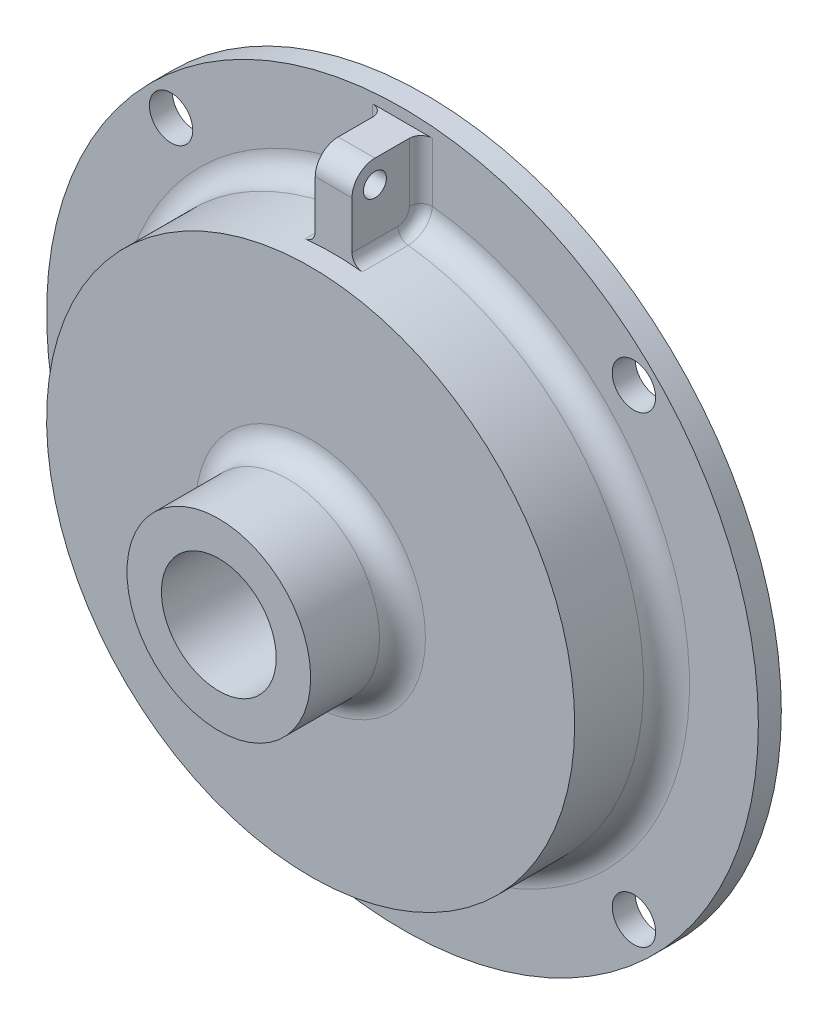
from build123d import *

# Parameters (mm, degrees)
SKETCH1_R                = 49.2125
BASE_EXTRUDE_DEPTH       = 3.175
F_6_0_6_DIAMETER_HOLE1_D = 6
SKETCH2_R                = 36.5125
BOSS_EXTRUDE1_DEPTH      = 12.7
SKETCH3_R                = 12.7
BOSS_EXTRUDE2_DEPTH      = 12.7
FILLET1_R                = 3.175
SKETCH6_W                = 5.08
SKETCH6_H                = 9.525
BOSS_EXTRUDE3_DEPTH      = 47.625
SKETCH4_R                = 7.9375
CUT_EXTRUDE1_DEPTH       = 76.23477213
FILLET2_R                = 3.175
CUT_EXTRUDE3_REACH       = 78.92
SKETCH7_R                = 1.5875
FILLET3_R                = 1.5875


with BuildPart() as part:
    # Sketch1 → Base-Extrude (new body)
    with BuildSketch(Plane.XY):
        Circle(SKETCH1_R)
    extrude(amount=BASE_EXTRUDE_DEPTH)

    # 6.0 _6_ Diameter Hole1 (through all)
    with Locations(Plane.XY.offset(3.175)):
        with Locations((32, 32), (-32, 32), (-32, -32), (32, -32)):
            Hole(F_6_0_6_DIAMETER_HOLE1_D / 2)

    # Sketch2 → Boss-Extrude1 (add)
    with BuildSketch(Plane.XY.offset(3.175)):
        Circle(SKETCH2_R)
    extrude(amount=BOSS_EXTRUDE1_DEPTH)

    # Sketch3 → Boss-Extrude2 (add)
    with BuildSketch(Plane.XY.offset(15.875)):
        Circle(SKETCH3_R)
    extrude(amount=BOSS_EXTRUDE2_DEPTH)

    # Fillet1
    fillet1_edges = [part.edges().sort_by_distance(p)[0] for p in [
        (-36.5125, 0, 3.175),
        (-12.7, 0, 15.875),
    ]]
    fillet(fillet1_edges, radius=FILLET1_R)

    # Sketch6 → Boss-Extrude3 (add)
    with BuildSketch(Plane(origin=(0, 0, 0), x_dir=(1, 0, 0), z_dir=(0, 1, 0))):
        with Locations((0, -7.9375)):
            Rectangle(SKETCH6_W, SKETCH6_H)
    extrude(amount=BOSS_EXTRUDE3_DEPTH)

    # Sketch4 → Cut-Extrude1 (cut, through all)
    with BuildSketch(Plane.XY.offset(28.575)):
        Circle(SKETCH4_R)
    extrude(amount=-CUT_EXTRUDE1_DEPTH, mode=Mode.SUBTRACT)

    # Fillet2
    fillet2_edges = [part.edges().sort_by_distance(p)[0] for p in [
        (0, 47.625, 12.7),
    ]]
    fillet(fillet2_edges, radius=FILLET2_R)

    # Sketch7 → Cut-Extrude3 (cut, up to next)
    with BuildSketch(Plane(origin=(2.54, 0, 0), x_dir=(0, 0, -1), z_dir=(1, 0, 0)), mode=Mode.PRIVATE) as cut_extrude3_sk1:
        with Locations((-9.525, 44.45)):
            Circle(SKETCH7_R)
    cut_extrude3_tool1 = extrude(cut_extrude3_sk1.sketch, amount=-CUT_EXTRUDE3_REACH, mode=Mode.PRIVATE) & part.part
    add(cut_extrude3_tool1.solids().sort_by_distance((2.54, 44.45, 9.525))[0], mode=Mode.SUBTRACT)

    # Fillet3
    fillet3_edges = [part.edges().sort_by_distance(p)[0] for p in [
        (2.54, 43.615568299, 3.175),
        (-2.54, 36.424045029, 9.5249997),
        (-2.54, 43.615568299, 3.175),
        (2.54, 36.424045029, 9.5249997),
    ]]
    fillet(fillet3_edges, radius=FILLET3_R)


solid = part.part
